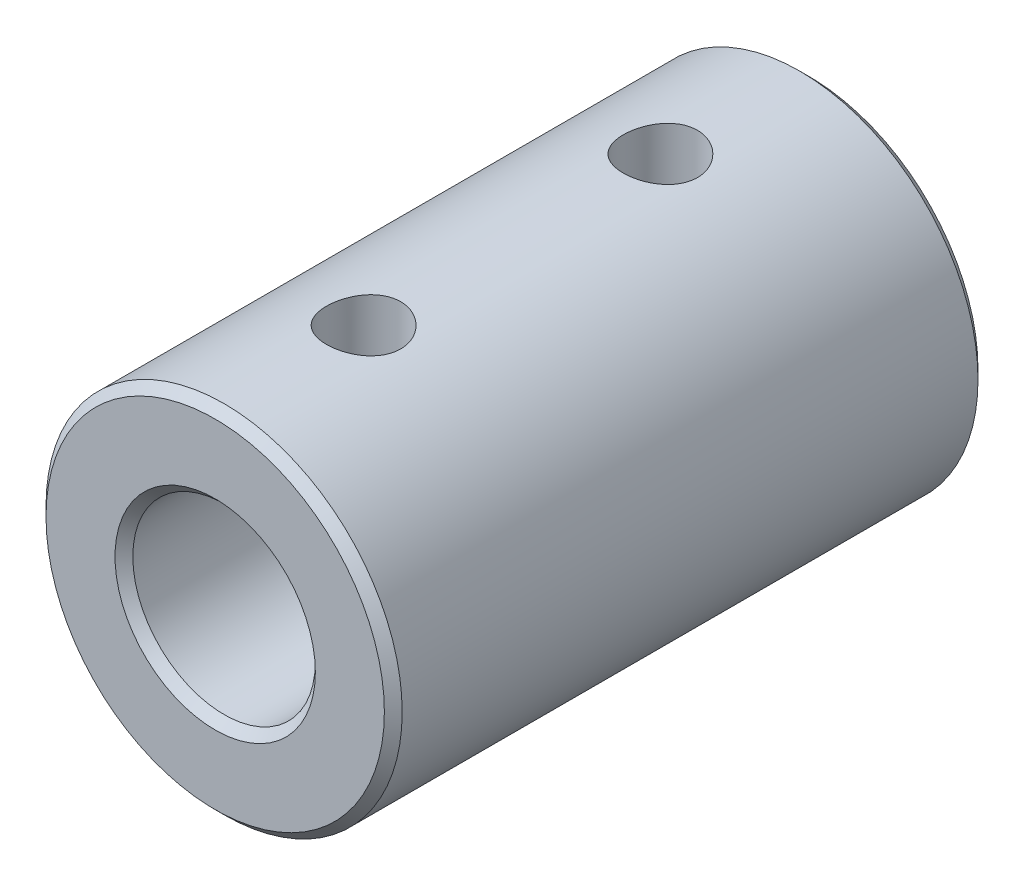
from build123d import *

# Parameters (mm, degrees)
ESQUISSE1_R             = 6
ESQUISSE1_R_2           = 3.075
BOSS_EXTRU_1_DEPTH      = 10
ESQUISSE3_R             = 1.25
ENL_V_MAT_EXTRU_2_DEPTH = 6
CHANFREIN1_SIZE         = 0.3


with BuildPart() as part:
    # Esquisse1 → Boss.-Extru.1 (new, symmetric)
    with BuildSketch(Plane.XY):
        Circle(ESQUISSE1_R)
        Circle(ESQUISSE1_R_2, mode=Mode.SUBTRACT)
    extrude(amount=BOSS_EXTRU_1_DEPTH, both=True)

    # Esquisse3 → Enl_v. mat.-Extru.2 (cut, symmetric)
    with BuildSketch(Plane(origin=(0, 0, 0), x_dir=(-1, 0, 0), z_dir=(0, 1, 0))):
        with Locations(Location((0, 5, 0), (0, 0, 90))):
            Circle(ESQUISSE3_R)
        with Locations(Location((0, -5, 0), (0, 0, 90))):
            Circle(ESQUISSE3_R)
    extrude(amount=ENL_V_MAT_EXTRU_2_DEPTH, both=True, mode=Mode.SUBTRACT)

    # Chanfrein1
    chanfrein1_edges = [part.edges().sort_by_distance(p)[0] for p in [
        (-6, 0, -10),
        (-6, 0, 10),
        (-3.075, 0, -10),
        (-3.075, 0, 10),
    ]]
    chamfer(chanfrein1_edges, length=CHANFREIN1_SIZE)


solid = part.part
